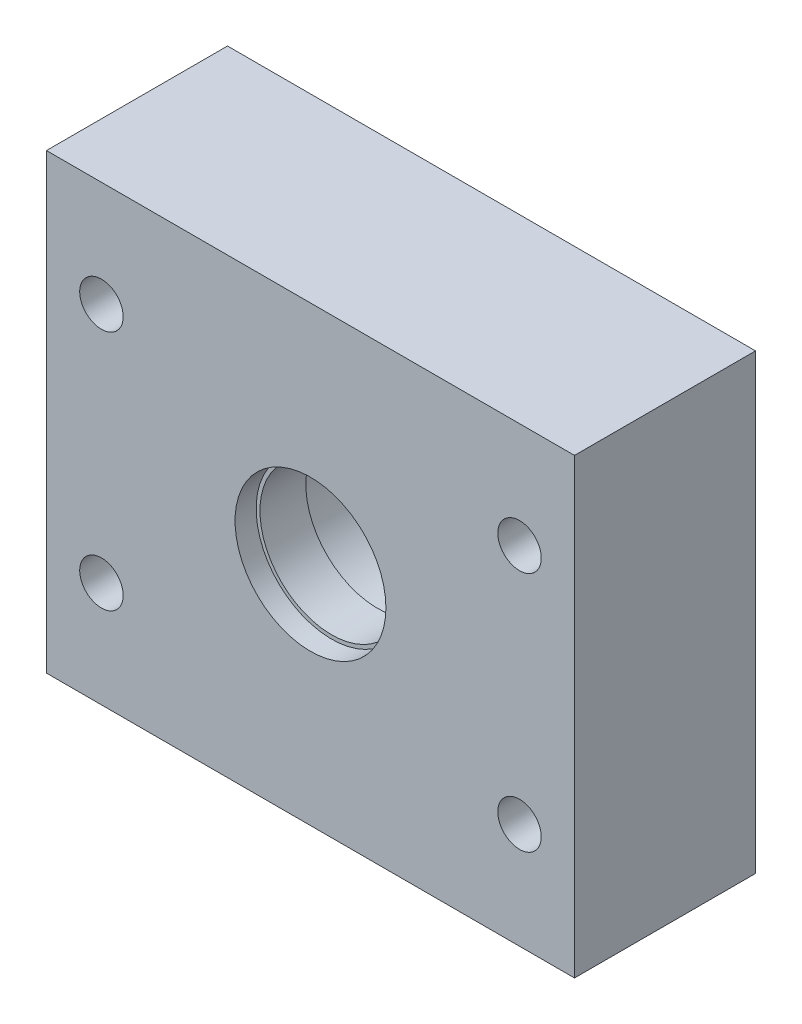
from build123d import *

# Parameters (mm, degrees)
SKETCH1_W          = 44.45
SKETCH1_H          = 38.1
EXTRUDE1_DEPTH     = 15.24
SKETCH6_R          = 1.8288
CUT_EXTRUDE3_DEPTH = 61.495207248
SKETCH7_R          = 1.8288
CUT_EXTRUDE4_DEPTH = 61.495207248
SKETCH5_R          = 2.3495
CUT_EXTRUDE2_DEPTH = 61.495207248
SKETCH9_R          = 6.0325
CUT_EXTRUDE5_DEPTH = 61.495207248
SKETCH10_R         = 6.35
CUT_EXTRUDE7_DEPTH = 1.778
CUT_EXTRUDE8_START = -9.6012
SKETCH11_R         = 6.35
CUT_EXTRUDE8_DEPTH = 9.6012


with BuildPart() as part:
    # Sketch1 → Extrude1 (new body)
    with BuildSketch(Plane.XY):
        with Locations((22.225, 19.05)):
            Rectangle(SKETCH1_W, SKETCH1_H)
    extrude(amount=EXTRUDE1_DEPTH)

    # Sketch6 → Cut-Extrude3 (cut, through all)
    with BuildSketch(Plane.XY.offset(15.24)):
        with Locations((4.627363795, 8.89)):
            Circle(SKETCH6_R)
    extrude(amount=-CUT_EXTRUDE3_DEPTH, mode=Mode.SUBTRACT)

    # Sketch7 → Cut-Extrude4 (cut, through all)
    with BuildSketch(Plane.XY.offset(15.24)):
        with Locations((4.627363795, 29.21)):
            Circle(SKETCH7_R)
        with Locations((39.822636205, 29.21)):
            Circle(SKETCH7_R)
        with Locations((39.822636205, 8.89)):
            Circle(SKETCH7_R)
    extrude(amount=-CUT_EXTRUDE4_DEPTH, mode=Mode.SUBTRACT)

    # Sketch5 → Cut-Extrude2 (cut, through all)
    with BuildSketch(Plane.XY.offset(15.24)):
        with Locations((22.225, 19.05)):
            Circle(SKETCH5_R)
    extrude(amount=-CUT_EXTRUDE2_DEPTH, mode=Mode.SUBTRACT)

    # Sketch9 → Cut-Extrude5 (cut, through all)
    with BuildSketch(Plane.XY.offset(15.24)):
        with Locations((22.225, 19.05)):
            Circle(SKETCH9_R)
    extrude(amount=-CUT_EXTRUDE5_DEPTH, mode=Mode.SUBTRACT)

    # Sketch10 → Cut-Extrude7 (cut)
    with BuildSketch(Plane.XY.offset(15.24)):
        with Locations((22.225, 19.05)):
            Circle(SKETCH10_R)
    extrude(amount=-CUT_EXTRUDE7_DEPTH, mode=Mode.SUBTRACT)

    # Sketch11 → Cut-Extrude8 (cut)
    with BuildSketch(Plane(origin=(0, 0, 0), x_dir=(-1, 0, 0), z_dir=(0, 0, -1)).offset(CUT_EXTRUDE8_START)):
        with Locations(Location((-22.225, 19.05, 0), (0, 0, 180))):
            Circle(SKETCH11_R)
    extrude(amount=CUT_EXTRUDE8_DEPTH, mode=Mode.SUBTRACT)


solid = part.part
